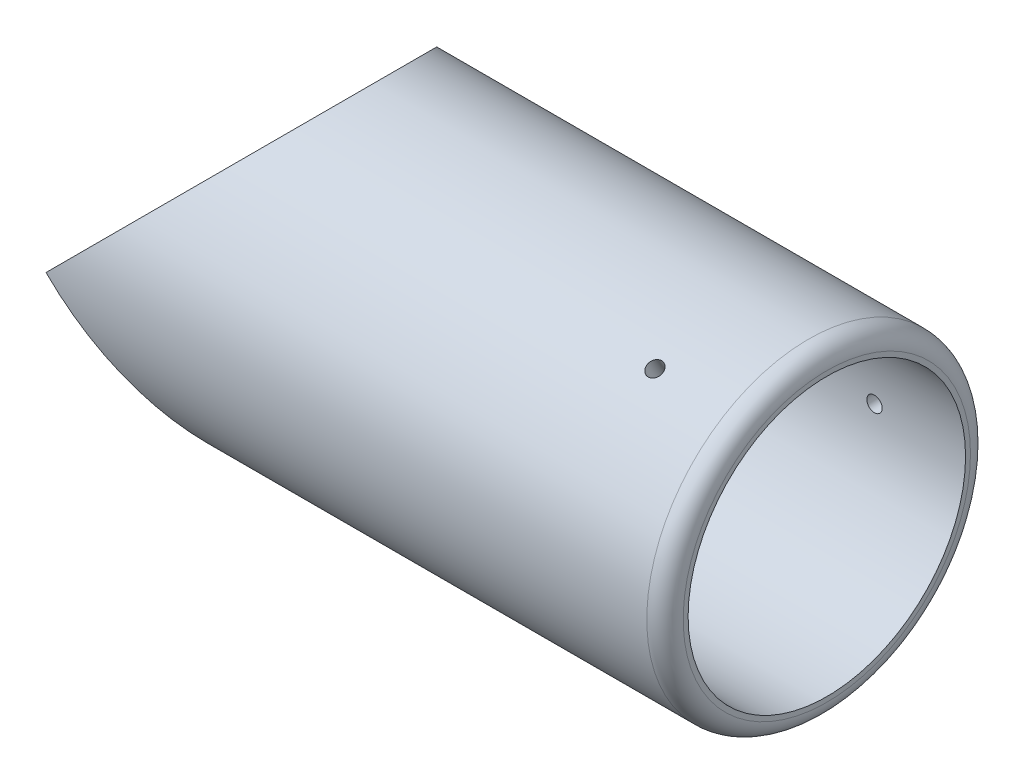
from build123d import *

# Parameters (mm, degrees)
SKETCH1_R                      = 44.45
SKETCH1_R_2                    = 31.75
BOSS_EXTRUDE1_DEPTH            = 170
CUT_EXTRUDE1_REACH             = 183.25
SKETCH2_R                      = 44.45
CUT_EXTRUDE1_DIRECTION_2_REACH = 183.25
SKETCH3_R                      = 38.1
CUT_EXTRUDE2_DEPTH             = 100.1
FILLET2_R                      = 5
M5X0_8_TAPPED_HOLE1_REACH      = 198.924
M5X0_8_TAPPED_HOLE1_BORE_R     = 2.1
CIRPATTERN1_COUNT              = 3


with BuildPart() as part:
    # Sketch1 → Boss-Extrude1 (new body)
    with BuildSketch(Plane(origin=(0, 0, 0), x_dir=(0, 0, -1), z_dir=(1, 0, 0))):
        Circle(SKETCH1_R)
        Circle(SKETCH1_R_2, mode=Mode.SUBTRACT)
    extrude(amount=BOSS_EXTRUDE1_DEPTH)

    # Sketch2 → Cut-Extrude1 (cut, up to next)
    with BuildSketch(Plane(origin=(0, 0, 0), x_dir=(1, 0, 0), z_dir=(0, 1, 0)), mode=Mode.PRIVATE) as cut_extrude1_sk1:
        Circle(SKETCH2_R)
    cut_extrude1_tool1 = extrude(cut_extrude1_sk1.sketch, amount=-CUT_EXTRUDE1_REACH, mode=Mode.PRIVATE) & part.part
    add(cut_extrude1_tool1.solids().sort_by_distance((0, 0, 0))[0], mode=Mode.SUBTRACT)

    # Sketch2 → Cut-Extrude1 direction 2 (cut, up to next)
    with BuildSketch(Plane(origin=(0, 0, 0), x_dir=(1, 0, 0), z_dir=(0, 1, 0)), mode=Mode.PRIVATE) as cut_extrude1_direction_2_sk1:
        Circle(SKETCH2_R)
    cut_extrude1_direction_2_tool1 = extrude(cut_extrude1_direction_2_sk1.sketch, amount=CUT_EXTRUDE1_DIRECTION_2_REACH, mode=Mode.PRIVATE) & part.part
    add(cut_extrude1_direction_2_tool1.solids().sort_by_distance((0, 0, 0))[0], mode=Mode.SUBTRACT)

    # Sketch3 → Cut-Extrude2 (cut)
    with BuildSketch(Plane(origin=(170, 0, 0), x_dir=(0, 0, -1), z_dir=(1, 0, 0))):
        Circle(SKETCH3_R)
    extrude(amount=-CUT_EXTRUDE2_DEPTH, mode=Mode.SUBTRACT)

    # Fillet2
    fillet2_edges = [part.edges().sort_by_distance(p)[0] for p in [
        (170, 0, 44.45),
    ]]
    fillet(fillet2_edges, radius=FILLET2_R)

    # M5x0.8 Tapped Hole1 bore → M5x0.8 Tapped Hole1 (cut, up to next)
    with BuildSketch(Plane(origin=(0, 0, -44.45), x_dir=(-1, 0, 0), z_dir=(0, 0, -1)), mode=Mode.PRIVATE) as m5x0_8_tapped_hole1_sk1:
        with Locations((-145, 0)):
            Circle(M5X0_8_TAPPED_HOLE1_BORE_R)
    m5x0_8_tapped_hole1_tool1 = extrude(m5x0_8_tapped_hole1_sk1.sketch, amount=-M5X0_8_TAPPED_HOLE1_REACH, mode=Mode.PRIVATE) & part.part
    m5x0_8_tapped_hole1 = m5x0_8_tapped_hole1_tool1.solids().sort_by_distance((145, 0, -44.45))[0]
    add(m5x0_8_tapped_hole1, mode=Mode.SUBTRACT)

    # CirPattern1: M5x0.8 Tapped Hole1 ×3 about axis
    cirpattern1_axis = Axis((69.9, 0, 0), (1, 0, 0))
    for i in range(1, CIRPATTERN1_COUNT):
        add(m5x0_8_tapped_hole1.rotate(cirpattern1_axis, i * 360 / CIRPATTERN1_COUNT), mode=Mode.SUBTRACT)


solid = part.part
